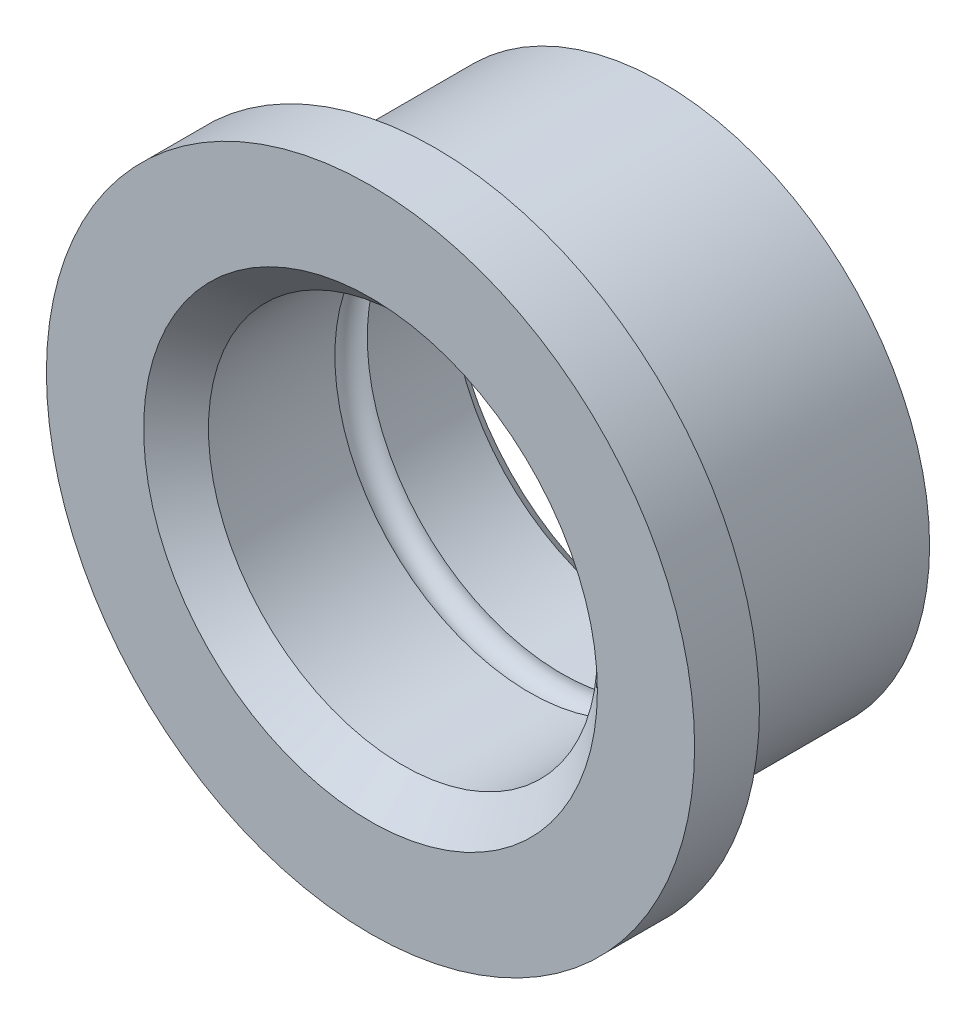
from build123d import *

# Parameters (mm, degrees)
ESQUISSE4_R          = 8.25
ESQUISSE4_R_2        = 6
BASE_EXTRUSION_DEPTH = 7
BOSS_EXTRU_2_START   = 2
ESQUISSE5_R          = 10
ESQUISSE5_R_2        = 6
BOSS_EXTRU_2_DEPTH   = 2
BOSS_EXTRU_3_DEPTH   = 4
CHANFREIN1_SIZE      = 0.5
CHANFREIN2_SIZE      = 1


with BuildPart() as part:
    # Esquisse4 → Base-Extrusion (new body)
    with BuildSketch(Plane.XY):
        with Locations((0, -31.75)):
            Circle(ESQUISSE4_R)
        with Locations((0, -31.75)):
            Circle(ESQUISSE4_R_2, mode=Mode.SUBTRACT)
    extrude(amount=-BASE_EXTRUSION_DEPTH)

    # Esquisse5 → Boss.-Extru.2 (add)
    with BuildSketch(Plane.XY.offset(BOSS_EXTRU_2_START)):
        with Locations((0, -31.75)):
            Circle(ESQUISSE5_R)
        with Locations((0, -31.75)):
            Circle(ESQUISSE5_R_2, mode=Mode.SUBTRACT)
    extrude(amount=-BOSS_EXTRU_2_DEPTH)

    # Esquisse8 → Boss.-Extru.3 (add)
    with BuildSketch(Plane(origin=(0, 0, 0), x_dir=(-1, 0, 0), z_dir=(0, 0, -1))):
        with BuildLine():
            Line((8.003905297, -29.75), (9.542667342, -29.75))
            ThreePointArc((9.542667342, -29.75), (9.75, -31.75), (9.542667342, -33.75))
            Line((9.542667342, -33.75), (8.003905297, -33.75))
            ThreePointArc((8.003905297, -33.75), (8.25, -31.75), (8.003905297, -29.75))
        make_face()
    extrude(amount=BOSS_EXTRU_3_DEPTH)

    # Esquisse9 → Enl_vement de mati_re-R_volution1 (revolve, cut)
    with BuildSketch(Plane.ZY, mode=Mode.PRIVATE) as enl_vement_de_mati_re_r_volution1_sk:
        with BuildLine():
            Line((-2.9, -25.75), (-3.9, -25.75))
            ThreePointArc((-3.9, -25.75), (-3.4, -25.25), (-2.9, -25.75))
        make_face()
    revolve(enl_vement_de_mati_re_r_volution1_sk.sketch.rotate(Axis((0, -31.75, 1.170452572), (0, 0, -1)), 90), axis=Axis((0, -31.75, 1.170452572), (0, 0, -1)), mode=Mode.SUBTRACT)

    # Chanfrein1
    chanfrein1_edges = [part.edges().sort_by_distance(p)[0] for p in [
        (-6, -31.75, -7),
    ]]
    chamfer(chanfrein1_edges, length=CHANFREIN1_SIZE)

    # Chanfrein2
    chanfrein2_edges = [part.edges().sort_by_distance(p)[0] for p in [
        (-6, -31.75, 2),
    ]]
    chamfer(chanfrein2_edges, length=CHANFREIN2_SIZE)


solid = part.part
